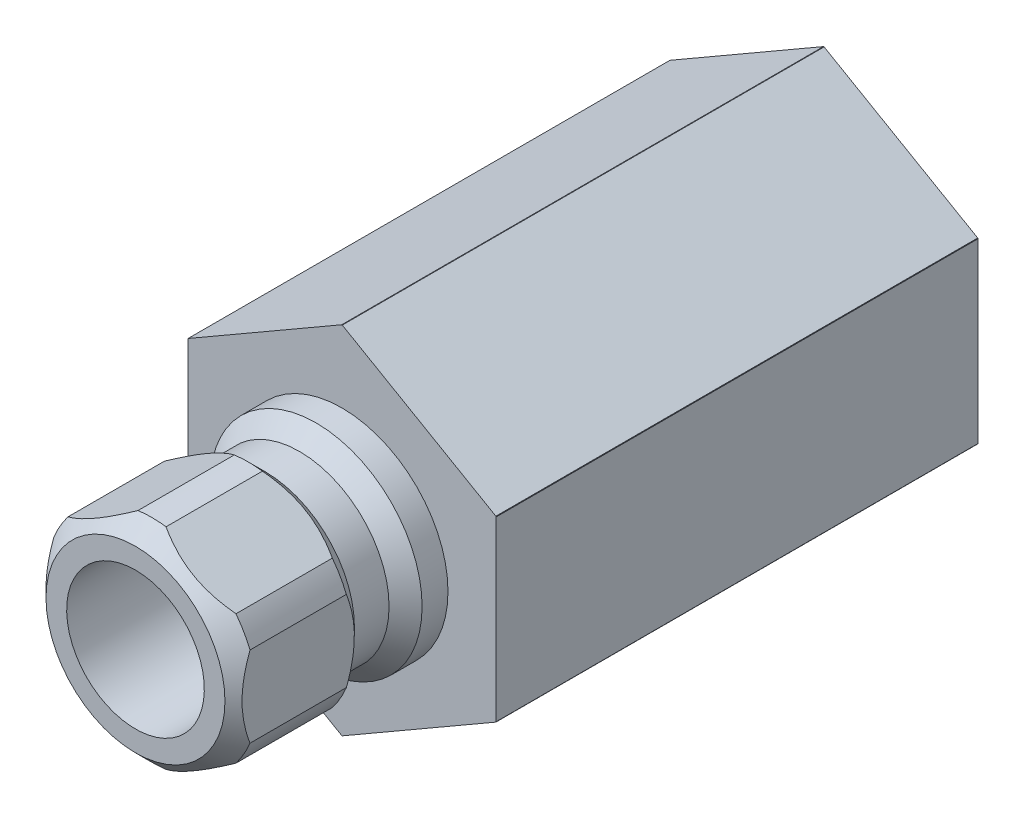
ISO-10303-21;
HEADER;
FILE_DESCRIPTION(('STEP AP214'),'2;1');
FILE_NAME('part.step','',(''),(''),'','','');
FILE_SCHEMA(('AUTOMOTIVE_DESIGN { 1 0 10303 214 1 1 1 1 }'));
ENDSEC;
DATA;
#1=APPLICATION_CONTEXT('core data for automotive mechanical design processes');
#2=APPLICATION_PROTOCOL_DEFINITION('international standard','automotive_design',2000,#1);
#3=PRODUCT_CONTEXT('',#1,'mechanical');
#4=PRODUCT('Part','Part','',(#3));
#5=PRODUCT_RELATED_PRODUCT_CATEGORY('part','',(#4));
#6=PRODUCT_DEFINITION_FORMATION('','',#4);
#7=PRODUCT_DEFINITION_CONTEXT('part definition',#1,'design');
#8=PRODUCT_DEFINITION('design','',#6,#7);
#9=PRODUCT_DEFINITION_SHAPE('','',#8);
#10=(LENGTH_UNIT() NAMED_UNIT(*) SI_UNIT(.MILLI.,.METRE.));
#11=(NAMED_UNIT(*) PLANE_ANGLE_UNIT() SI_UNIT($,.RADIAN.));
#12=(NAMED_UNIT(*) SI_UNIT($,.STERADIAN.) SOLID_ANGLE_UNIT());
#13=UNCERTAINTY_MEASURE_WITH_UNIT(LENGTH_MEASURE(1.E-05),#10,'distance_accuracy_value','');
#14=(GEOMETRIC_REPRESENTATION_CONTEXT(3) GLOBAL_UNCERTAINTY_ASSIGNED_CONTEXT((#13)) GLOBAL_UNIT_ASSIGNED_CONTEXT((#10,
#11,#12)) REPRESENTATION_CONTEXT('',''));
#15=CARTESIAN_POINT('',(0.,0.,0.));
#16=DIRECTION('',(0.,0.,1.));
#17=DIRECTION('',(1.,0.,0.));
#18=AXIS2_PLACEMENT_3D('',#15,#16,#17);
#19=CARTESIAN_POINT('',(0.,0.,0.));
#20=DIRECTION('',(0.,0.,-1.));
#21=DIRECTION('',(0.,1.,0.));
#22=AXIS2_PLACEMENT_3D('',#19,#20,#21);
#23=CYLINDRICAL_SURFACE('',#22,4.8895);
#24=DIRECTION('',(0.,0.,-1.));
#25=VECTOR('',#24,1.);
#26=CARTESIAN_POINT('',(-3.87288738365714,2.98461950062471,0.));
#27=LINE('',#26,#25);
#28=CARTESIAN_POINT('',(-3.87288738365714,2.98461950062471,4.318));
#29=VERTEX_POINT('',#28);
#30=CARTESIAN_POINT('',(-3.87288738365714,2.98461950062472,8.763));
#31=VERTEX_POINT('',#30);
#32=EDGE_CURVE('E54',#29,#31,#27,.F.);
#33=ORIENTED_EDGE('',*,*,#32,.F.);
#34=CARTESIAN_POINT('',(0.,0.,4.318));
#35=DIRECTION('',(0.,0.,-1.));
#36=DIRECTION('',(0.,1.,0.));
#37=AXIS2_PLACEMENT_3D('',#34,#35,#36);
#38=CIRCLE('',#37,4.8895);
#39=CARTESIAN_POINT('',(-4.5212,1.86170910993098,4.318));
#40=VERTEX_POINT('',#39);
#41=EDGE_CURVE('E231',#40,#29,#38,.T.);
#42=ORIENTED_EDGE('',*,*,#41,.F.);
#43=DIRECTION('',(0.,0.,-1.));
#44=VECTOR('',#43,1.);
#45=CARTESIAN_POINT('',(-4.5212,1.86170910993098,0.));
#46=LINE('',#45,#44);
#47=CARTESIAN_POINT('',(-4.5212,1.86170910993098,8.763));
#48=VERTEX_POINT('',#47);
#49=EDGE_CURVE('E411',#48,#40,#46,.T.);
#50=ORIENTED_EDGE('',*,*,#49,.F.);
#51=CARTESIAN_POINT('',(0.,0.,8.763));
#52=DIRECTION('',(0.,0.,-1.));
#53=DIRECTION('',(0.,1.,0.));
#54=AXIS2_PLACEMENT_3D('',#51,#52,#53);
#55=CIRCLE('',#54,4.8895);
#56=EDGE_CURVE('E236',#48,#31,#55,.T.);
#57=ORIENTED_EDGE('',*,*,#56,.T.);
#58=EDGE_LOOP('',(#33,#42,#50,#57));
#59=FACE_BOUND('',#58,.T.);
#60=ADVANCED_FACE('F35',(#59),#23,.T.);
#61=DIRECTION('',(0.,0.,-1.));
#62=VECTOR('',#61,1.);
#63=CARTESIAN_POINT('',(-4.5212,-1.86170910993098,0.));
#64=LINE('',#63,#62);
#65=CARTESIAN_POINT('',(-4.5212,-1.86170910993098,4.318));
#66=VERTEX_POINT('',#65);
#67=CARTESIAN_POINT('',(-4.5212,-1.86170910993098,8.763));
#68=VERTEX_POINT('',#67);
#69=EDGE_CURVE('E62',#66,#68,#64,.F.);
#70=ORIENTED_EDGE('',*,*,#69,.F.);
#71=CARTESIAN_POINT('',(-3.87288738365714,-2.98461950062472,4.318));
#72=VERTEX_POINT('',#71);
#73=EDGE_CURVE('E468',#72,#66,#38,.T.);
#74=ORIENTED_EDGE('',*,*,#73,.F.);
#75=DIRECTION('',(0.,0.,-1.));
#76=VECTOR('',#75,1.);
#77=CARTESIAN_POINT('',(-3.87288738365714,-2.98461950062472,0.));
#78=LINE('',#77,#76);
#79=CARTESIAN_POINT('',(-3.87288738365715,-2.98461950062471,8.763));
#80=VERTEX_POINT('',#79);
#81=EDGE_CURVE('E406',#80,#72,#78,.T.);
#82=ORIENTED_EDGE('',*,*,#81,.F.);
#83=EDGE_CURVE('E241',#80,#68,#55,.T.);
#84=ORIENTED_EDGE('',*,*,#83,.T.);
#85=EDGE_LOOP('',(#70,#74,#82,#84));
#86=FACE_BOUND('',#85,.T.);
#87=ADVANCED_FACE('F403',(#86),#23,.T.);
#88=DIRECTION('',(0.,0.,-1.));
#89=VECTOR('',#88,1.);
#90=CARTESIAN_POINT('',(-0.64831261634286,-4.84632861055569,0.));
#91=LINE('',#90,#89);
#92=CARTESIAN_POINT('',(-0.64831261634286,-4.84632861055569,4.318));
#93=VERTEX_POINT('',#92);
#94=CARTESIAN_POINT('',(-0.648312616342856,-4.84632861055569,8.763));
#95=VERTEX_POINT('',#94);
#96=EDGE_CURVE('E417',#93,#95,#91,.F.);
#97=ORIENTED_EDGE('',*,*,#96,.F.);
#98=CARTESIAN_POINT('',(0.648312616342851,-4.84632861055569,4.318));
#99=VERTEX_POINT('',#98);
#100=EDGE_CURVE('E466',#99,#93,#38,.T.);
#101=ORIENTED_EDGE('',*,*,#100,.F.);
#102=DIRECTION('',(0.,0.,-1.));
#103=VECTOR('',#102,1.);
#104=CARTESIAN_POINT('',(0.648312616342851,-4.84632861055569,0.));
#105=LINE('',#104,#103);
#106=CARTESIAN_POINT('',(0.648312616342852,-4.84632861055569,8.763));
#107=VERTEX_POINT('',#106);
#108=EDGE_CURVE('E452',#107,#99,#105,.T.);
#109=ORIENTED_EDGE('',*,*,#108,.F.);
#110=EDGE_CURVE('E234',#107,#95,#55,.T.);
#111=ORIENTED_EDGE('',*,*,#110,.T.);
#112=EDGE_LOOP('',(#97,#101,#109,#111));
#113=FACE_BOUND('',#112,.T.);
#114=ADVANCED_FACE('F465',(#113),#23,.T.);
#115=DIRECTION('',(0.,0.,-1.));
#116=VECTOR('',#115,1.);
#117=CARTESIAN_POINT('',(3.87288738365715,-2.98461950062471,0.));
#118=LINE('',#117,#116);
#119=CARTESIAN_POINT('',(3.87288738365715,-2.98461950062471,4.318));
#120=VERTEX_POINT('',#119);
#121=CARTESIAN_POINT('',(3.87288738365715,-2.98461950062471,8.763));
#122=VERTEX_POINT('',#121);
#123=EDGE_CURVE('E454',#120,#122,#118,.F.);
#124=ORIENTED_EDGE('',*,*,#123,.F.);
#125=CARTESIAN_POINT('',(4.5212,-1.86170910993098,4.318));
#126=VERTEX_POINT('',#125);
#127=EDGE_CURVE('E393',#126,#120,#38,.T.);
#128=ORIENTED_EDGE('',*,*,#127,.F.);
#129=DIRECTION('',(0.,0.,-1.));
#130=VECTOR('',#129,1.);
#131=CARTESIAN_POINT('',(4.5212,-1.86170910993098,0.));
#132=LINE('',#131,#130);
#133=CARTESIAN_POINT('',(4.5212,-1.86170910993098,8.763));
#134=VERTEX_POINT('',#133);
#135=EDGE_CURVE('E385',#134,#126,#132,.T.);
#136=ORIENTED_EDGE('',*,*,#135,.F.);
#137=EDGE_CURVE('E227',#134,#122,#55,.T.);
#138=ORIENTED_EDGE('',*,*,#137,.T.);
#139=EDGE_LOOP('',(#124,#128,#136,#138));
#140=FACE_BOUND('',#139,.T.);
#141=ADVANCED_FACE('F391',(#140),#23,.T.);
#142=DIRECTION('',(0.,0.,-1.));
#143=VECTOR('',#142,1.);
#144=CARTESIAN_POINT('',(4.5212,1.86170910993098,0.));
#145=LINE('',#144,#143);
#146=CARTESIAN_POINT('',(4.5212,1.86170910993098,4.318));
#147=VERTEX_POINT('',#146);
#148=CARTESIAN_POINT('',(4.5212,1.86170910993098,8.763));
#149=VERTEX_POINT('',#148);
#150=EDGE_CURVE('E387',#147,#149,#145,.F.);
#151=ORIENTED_EDGE('',*,*,#150,.F.);
#152=CARTESIAN_POINT('',(3.87288738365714,2.98461950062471,4.318));
#153=VERTEX_POINT('',#152);
#154=EDGE_CURVE('E220',#153,#147,#38,.T.);
#155=ORIENTED_EDGE('',*,*,#154,.F.);
#156=DIRECTION('',(0.,0.,-1.));
#157=VECTOR('',#156,1.);
#158=CARTESIAN_POINT('',(3.87288738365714,2.98461950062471,0.));
#159=LINE('',#158,#157);
#160=CARTESIAN_POINT('',(3.87288738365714,2.98461950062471,8.763));
#161=VERTEX_POINT('',#160);
#162=EDGE_CURVE('E202',#161,#153,#159,.T.);
#163=ORIENTED_EDGE('',*,*,#162,.F.);
#164=EDGE_CURVE('E218',#161,#149,#55,.T.);
#165=ORIENTED_EDGE('',*,*,#164,.T.);
#166=EDGE_LOOP('',(#151,#155,#163,#165));
#167=FACE_BOUND('',#166,.T.);
#168=ADVANCED_FACE('F217',(#167),#23,.T.);
#169=CARTESIAN_POINT('',(0.,8.2042,-22.225));
#170=DIRECTION('',(0.,0.,-1.));
#171=DIRECTION('',(0.,1.,0.));
#172=AXIS2_PLACEMENT_3D('',#169,#170,#171);
#173=PLANE('',#172);
#174=CARTESIAN_POINT('',(0.,0.,-22.225));
#175=DIRECTION('',(0.,0.,-1.));
#176=DIRECTION('',(0.,1.,0.));
#177=AXIS2_PLACEMENT_3D('',#174,#175,#176);
#178=CIRCLE('',#177,5.91938847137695);
#179=CARTESIAN_POINT('',(0.,5.91938847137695,-22.225));
#180=VERTEX_POINT('',#179);
#181=EDGE_CURVE('E492',#180,#180,#178,.T.);
#182=ORIENTED_EDGE('',*,*,#181,.F.);
#183=EDGE_LOOP('',(#182));
#184=FACE_BOUND('',#183,.T.);
#185=CARTESIAN_POINT('',(0.,0.,-22.225));
#186=DIRECTION('',(0.,0.,-1.));
#187=DIRECTION('',(0.,1.,0.));
#188=AXIS2_PLACEMENT_3D('',#185,#186,#187);
#189=CIRCLE('',#188,8.2042);
#190=CARTESIAN_POINT('',(-7.112,4.09003100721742,-22.225));
#191=VERTEX_POINT('',#190);
#192=CARTESIAN_POINT('',(-7.09807075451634,4.11415716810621,-22.225));
#193=VERTEX_POINT('',#192);
#194=EDGE_CURVE('E490',#191,#193,#189,.T.);
#195=ORIENTED_EDGE('',*,*,#194,.T.);
#196=DIRECTION('',(-0.866025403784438,-0.5,0.));
#197=VECTOR('',#196,1.);
#198=CARTESIAN_POINT('',(0.,8.21223022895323,-22.225));
#199=LINE('',#198,#197);
#200=CARTESIAN_POINT('',(-0.0139292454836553,8.20418817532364,-22.225));
#201=VERTEX_POINT('',#200);
#202=EDGE_CURVE('E294',#201,#193,#199,.T.);
#203=ORIENTED_EDGE('',*,*,#202,.F.);
#204=CARTESIAN_POINT('',(0.0139292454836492,8.20418817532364,-22.225));
#205=VERTEX_POINT('',#204);
#206=EDGE_CURVE('E487',#201,#205,#189,.T.);
#207=ORIENTED_EDGE('',*,*,#206,.T.);
#208=DIRECTION('',(-0.866025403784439,0.5,0.));
#209=VECTOR('',#208,1.);
#210=CARTESIAN_POINT('',(7.112,4.10611511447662,-22.225));
#211=LINE('',#210,#209);
#212=CARTESIAN_POINT('',(7.09807075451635,4.11415716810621,-22.225));
#213=VERTEX_POINT('',#212);
#214=EDGE_CURVE('E284',#213,#205,#211,.T.);
#215=ORIENTED_EDGE('',*,*,#214,.F.);
#216=CARTESIAN_POINT('',(7.112,4.09003100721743,-22.225));
#217=VERTEX_POINT('',#216);
#218=EDGE_CURVE('E491',#213,#217,#189,.T.);
#219=ORIENTED_EDGE('',*,*,#218,.T.);
#220=DIRECTION('',(0.,1.,0.));
#221=VECTOR('',#220,1.);
#222=CARTESIAN_POINT('',(7.112,-4.10611511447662,-22.225));
#223=LINE('',#222,#221);
#224=CARTESIAN_POINT('',(7.112,-4.09003100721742,-22.225));
#225=VERTEX_POINT('',#224);
#226=EDGE_CURVE('E286',#225,#217,#223,.T.);
#227=ORIENTED_EDGE('',*,*,#226,.F.);
#228=CARTESIAN_POINT('',(7.09807075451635,-4.11415716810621,-22.225));
#229=VERTEX_POINT('',#228);
#230=EDGE_CURVE('E547',#225,#229,#189,.T.);
#231=ORIENTED_EDGE('',*,*,#230,.T.);
#232=DIRECTION('',(0.866025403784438,0.5,0.));
#233=VECTOR('',#232,1.);
#234=CARTESIAN_POINT('',(0.,-8.21223022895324,-22.225));
#235=LINE('',#234,#233);
#236=CARTESIAN_POINT('',(0.0139292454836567,-8.20418817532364,-22.225));
#237=VERTEX_POINT('',#236);
#238=EDGE_CURVE('E288',#237,#229,#235,.T.);
#239=ORIENTED_EDGE('',*,*,#238,.F.);
#240=CARTESIAN_POINT('',(-0.0139292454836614,-8.20418817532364,-22.225));
#241=VERTEX_POINT('',#240);
#242=EDGE_CURVE('E550',#237,#241,#189,.T.);
#243=ORIENTED_EDGE('',*,*,#242,.T.);
#244=DIRECTION('',(0.866025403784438,-0.5,0.));
#245=VECTOR('',#244,1.);
#246=CARTESIAN_POINT('',(-7.112,-4.10611511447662,-22.225));
#247=LINE('',#246,#245);
#248=CARTESIAN_POINT('',(-7.09807075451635,-4.11415716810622,-22.225));
#249=VERTEX_POINT('',#248);
#250=EDGE_CURVE('E290',#249,#241,#247,.T.);
#251=ORIENTED_EDGE('',*,*,#250,.F.);
#252=CARTESIAN_POINT('',(-7.112,-4.09003100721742,-22.225));
#253=VERTEX_POINT('',#252);
#254=EDGE_CURVE('E552',#249,#253,#189,.T.);
#255=ORIENTED_EDGE('',*,*,#254,.T.);
#256=DIRECTION('',(0.,-1.,0.));
#257=VECTOR('',#256,1.);
#258=CARTESIAN_POINT('',(-7.112,4.10611511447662,-22.225));
#259=LINE('',#258,#257);
#260=EDGE_CURVE('E292',#191,#253,#259,.T.);
#261=ORIENTED_EDGE('',*,*,#260,.F.);
#262=EDGE_LOOP('',(#195,#203,#207,#215,#219,#227,#231,#239,#243,#251,#255,#261));
#263=FACE_BOUND('',#262,.T.);
#264=ADVANCED_FACE('F559',(#184,#263),#173,.T.);
#265=CARTESIAN_POINT('',(0.,0.,0.));
#266=DIRECTION('',(0.,0.,-1.));
#267=DIRECTION('',(0.,1.,0.));
#268=AXIS2_PLACEMENT_3D('',#265,#266,#267);
#269=CYLINDRICAL_SURFACE('',#268,8.2042);
#270=ORIENTED_EDGE('',*,*,#206,.F.);
#271=DIRECTION('',(0.,0.,-1.));
#272=VECTOR('',#271,1.);
#273=CARTESIAN_POINT('',(-0.0139292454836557,8.20418817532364,0.));
#274=LINE('',#273,#272);
#275=CARTESIAN_POINT('',(-0.0139292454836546,8.20418817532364,0.));
#276=VERTEX_POINT('',#275);
#277=EDGE_CURVE('E246',#201,#276,#274,.F.);
#278=ORIENTED_EDGE('',*,*,#277,.T.);
#279=CARTESIAN_POINT('',(0.,0.,0.));
#280=DIRECTION('',(0.,0.,-1.));
#281=DIRECTION('',(0.,1.,0.));
#282=AXIS2_PLACEMENT_3D('',#279,#280,#281);
#283=CIRCLE('',#282,8.2042);
#284=CARTESIAN_POINT('',(0.0139292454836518,8.20418817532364,0.));
#285=VERTEX_POINT('',#284);
#286=EDGE_CURVE('E482',#276,#285,#283,.T.);
#287=ORIENTED_EDGE('',*,*,#286,.T.);
#288=DIRECTION('',(0.,0.,-1.));
#289=VECTOR('',#288,1.);
#290=CARTESIAN_POINT('',(0.0139292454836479,8.20418817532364,0.));
#291=LINE('',#290,#289);
#292=EDGE_CURVE('E257',#285,#205,#291,.T.);
#293=ORIENTED_EDGE('',*,*,#292,.T.);
#294=EDGE_LOOP('',(#270,#278,#287,#293));
#295=FACE_BOUND('',#294,.T.);
#296=ADVANCED_FACE('F569',(#295),#269,.T.);
#297=CARTESIAN_POINT('',(-7.112,4.09003100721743,0.));
#298=VERTEX_POINT('',#297);
#299=CARTESIAN_POINT('',(-7.09807075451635,4.11415716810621,0.));
#300=VERTEX_POINT('',#299);
#301=EDGE_CURVE('E485',#298,#300,#283,.T.);
#302=ORIENTED_EDGE('',*,*,#301,.T.);
#303=DIRECTION('',(0.,0.,-1.));
#304=VECTOR('',#303,1.);
#305=CARTESIAN_POINT('',(-7.09807075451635,4.11415716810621,0.));
#306=LINE('',#305,#304);
#307=EDGE_CURVE('E251',#300,#193,#306,.T.);
#308=ORIENTED_EDGE('',*,*,#307,.T.);
#309=ORIENTED_EDGE('',*,*,#194,.F.);
#310=DIRECTION('',(0.,0.,-1.));
#311=VECTOR('',#310,1.);
#312=CARTESIAN_POINT('',(-7.112,4.09003100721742,0.));
#313=LINE('',#312,#311);
#314=EDGE_CURVE('E278',#191,#298,#313,.F.);
#315=ORIENTED_EDGE('',*,*,#314,.T.);
#316=EDGE_LOOP('',(#302,#308,#309,#315));
#317=FACE_BOUND('',#316,.T.);
#318=ADVANCED_FACE('F522',(#317),#269,.T.);
#319=ORIENTED_EDGE('',*,*,#218,.F.);
#320=DIRECTION('',(0.,0.,-1.));
#321=VECTOR('',#320,1.);
#322=CARTESIAN_POINT('',(7.09807075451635,4.11415716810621,0.));
#323=LINE('',#322,#321);
#324=CARTESIAN_POINT('',(7.09807075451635,4.11415716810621,0.));
#325=VERTEX_POINT('',#324);
#326=EDGE_CURVE('E254',#213,#325,#323,.F.);
#327=ORIENTED_EDGE('',*,*,#326,.T.);
#328=CARTESIAN_POINT('',(7.112,4.09003100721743,0.));
#329=VERTEX_POINT('',#328);
#330=EDGE_CURVE('E486',#325,#329,#283,.T.);
#331=ORIENTED_EDGE('',*,*,#330,.T.);
#332=DIRECTION('',(0.,0.,-1.));
#333=VECTOR('',#332,1.);
#334=CARTESIAN_POINT('',(7.112,4.09003100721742,0.));
#335=LINE('',#334,#333);
#336=EDGE_CURVE('E263',#329,#217,#335,.T.);
#337=ORIENTED_EDGE('',*,*,#336,.T.);
#338=EDGE_LOOP('',(#319,#327,#331,#337));
#339=FACE_BOUND('',#338,.T.);
#340=ADVANCED_FACE('F541',(#339),#269,.T.);
#341=ORIENTED_EDGE('',*,*,#230,.F.);
#342=DIRECTION('',(0.,0.,-1.));
#343=VECTOR('',#342,1.);
#344=CARTESIAN_POINT('',(7.112,-4.09003100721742,0.));
#345=LINE('',#344,#343);
#346=CARTESIAN_POINT('',(7.112,-4.09003100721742,0.));
#347=VERTEX_POINT('',#346);
#348=EDGE_CURVE('E260',#225,#347,#345,.F.);
#349=ORIENTED_EDGE('',*,*,#348,.T.);
#350=CARTESIAN_POINT('',(7.09807075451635,-4.11415716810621,0.));
#351=VERTEX_POINT('',#350);
#352=EDGE_CURVE('E531',#347,#351,#283,.T.);
#353=ORIENTED_EDGE('',*,*,#352,.T.);
#354=DIRECTION('',(0.,0.,-1.));
#355=VECTOR('',#354,1.);
#356=CARTESIAN_POINT('',(7.09807075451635,-4.11415716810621,0.));
#357=LINE('',#356,#355);
#358=EDGE_CURVE('E269',#351,#229,#357,.T.);
#359=ORIENTED_EDGE('',*,*,#358,.T.);
#360=EDGE_LOOP('',(#341,#349,#353,#359));
#361=FACE_BOUND('',#360,.T.);
#362=ADVANCED_FACE('F545',(#361),#269,.T.);
#363=ORIENTED_EDGE('',*,*,#242,.F.);
#364=DIRECTION('',(0.,0.,-1.));
#365=VECTOR('',#364,1.);
#366=CARTESIAN_POINT('',(0.0139292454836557,-8.20418817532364,0.));
#367=LINE('',#366,#365);
#368=CARTESIAN_POINT('',(0.0139292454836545,-8.20418817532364,0.));
#369=VERTEX_POINT('',#368);
#370=EDGE_CURVE('E266',#237,#369,#367,.F.);
#371=ORIENTED_EDGE('',*,*,#370,.T.);
#372=CARTESIAN_POINT('',(-0.0139292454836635,-8.20418817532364,0.));
#373=VERTEX_POINT('',#372);
#374=EDGE_CURVE('E527',#369,#373,#283,.T.);
#375=ORIENTED_EDGE('',*,*,#374,.T.);
#376=DIRECTION('',(0.,0.,-1.));
#377=VECTOR('',#376,1.);
#378=CARTESIAN_POINT('',(-0.0139292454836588,-8.20418817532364,0.));
#379=LINE('',#378,#377);
#380=EDGE_CURVE('E275',#373,#241,#379,.T.);
#381=ORIENTED_EDGE('',*,*,#380,.T.);
#382=EDGE_LOOP('',(#363,#371,#375,#381));
#383=FACE_BOUND('',#382,.T.);
#384=ADVANCED_FACE('F562',(#383),#269,.T.);
#385=ORIENTED_EDGE('',*,*,#254,.F.);
#386=DIRECTION('',(0.,0.,-1.));
#387=VECTOR('',#386,1.);
#388=CARTESIAN_POINT('',(-7.09807075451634,-4.11415716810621,0.));
#389=LINE('',#388,#387);
#390=CARTESIAN_POINT('',(-7.09807075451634,-4.11415716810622,0.));
#391=VERTEX_POINT('',#390);
#392=EDGE_CURVE('E272',#249,#391,#389,.F.);
#393=ORIENTED_EDGE('',*,*,#392,.T.);
#394=CARTESIAN_POINT('',(-7.112,-4.09003100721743,0.));
#395=VERTEX_POINT('',#394);
#396=EDGE_CURVE('E525',#391,#395,#283,.T.);
#397=ORIENTED_EDGE('',*,*,#396,.T.);
#398=DIRECTION('',(0.,0.,-1.));
#399=VECTOR('',#398,1.);
#400=CARTESIAN_POINT('',(-7.112,-4.09003100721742,0.));
#401=LINE('',#400,#399);
#402=EDGE_CURVE('E281',#395,#253,#401,.T.);
#403=ORIENTED_EDGE('',*,*,#402,.T.);
#404=EDGE_LOOP('',(#385,#393,#397,#403));
#405=FACE_BOUND('',#404,.T.);
#406=ADVANCED_FACE('F561',(#405),#269,.T.);
#407=CARTESIAN_POINT('',(0.,4.8895,0.));
#408=DIRECTION('',(0.,0.,1.));
#409=DIRECTION('',(0.,-1.,0.));
#410=AXIS2_PLACEMENT_3D('',#407,#408,#409);
#411=PLANE('',#410);
#412=CARTESIAN_POINT('',(0.,0.,0.));
#413=DIRECTION('',(0.,0.,-1.));
#414=DIRECTION('',(0.,1.,0.));
#415=AXIS2_PLACEMENT_3D('',#412,#413,#414);
#416=CIRCLE('',#415,4.8895);
#417=CARTESIAN_POINT('',(0.,4.8895,0.));
#418=VERTEX_POINT('',#417);
#419=EDGE_CURVE('E479',#418,#418,#416,.T.);
#420=ORIENTED_EDGE('',*,*,#419,.T.);
#421=EDGE_LOOP('',(#420));
#422=FACE_BOUND('',#421,.T.);
#423=ORIENTED_EDGE('',*,*,#286,.F.);
#424=DIRECTION('',(-0.866025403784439,-0.5,0.));
#425=VECTOR('',#424,1.);
#426=CARTESIAN_POINT('',(-1.43878439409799,7.38154767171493,0.));
#427=LINE('',#426,#425);
#428=EDGE_CURVE('E211',#276,#300,#427,.T.);
#429=ORIENTED_EDGE('',*,*,#428,.T.);
#430=ORIENTED_EDGE('',*,*,#301,.F.);
#431=DIRECTION('',(0.,-1.,0.));
#432=VECTOR('',#431,1.);
#433=CARTESIAN_POINT('',(-7.112,4.8895,0.));
#434=LINE('',#433,#432);
#435=EDGE_CURVE('E501',#298,#395,#434,.T.);
#436=ORIENTED_EDGE('',*,*,#435,.T.);
#437=ORIENTED_EDGE('',*,*,#396,.F.);
#438=DIRECTION('',(0.866025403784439,-0.5,0.));
#439=VECTOR('',#438,1.);
#440=CARTESIAN_POINT('',(-5.67321560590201,-4.93679767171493,0.));
#441=LINE('',#440,#439);
#442=EDGE_CURVE('E504',#391,#373,#441,.T.);
#443=ORIENTED_EDGE('',*,*,#442,.T.);
#444=ORIENTED_EDGE('',*,*,#374,.F.);
#445=DIRECTION('',(0.866025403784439,0.5,0.));
#446=VECTOR('',#445,1.);
#447=CARTESIAN_POINT('',(5.67321560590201,-4.93679767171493,0.));
#448=LINE('',#447,#446);
#449=EDGE_CURVE('E507',#369,#351,#448,.T.);
#450=ORIENTED_EDGE('',*,*,#449,.T.);
#451=ORIENTED_EDGE('',*,*,#352,.F.);
#452=DIRECTION('',(0.,1.,0.));
#453=VECTOR('',#452,1.);
#454=CARTESIAN_POINT('',(7.112,4.8895,0.));
#455=LINE('',#454,#453);
#456=EDGE_CURVE('E510',#347,#329,#455,.T.);
#457=ORIENTED_EDGE('',*,*,#456,.T.);
#458=ORIENTED_EDGE('',*,*,#330,.F.);
#459=DIRECTION('',(-0.866025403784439,0.5,0.));
#460=VECTOR('',#459,1.);
#461=CARTESIAN_POINT('',(1.43878439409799,7.38154767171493,0.));
#462=LINE('',#461,#460);
#463=EDGE_CURVE('E513',#325,#285,#462,.T.);
#464=ORIENTED_EDGE('',*,*,#463,.T.);
#465=EDGE_LOOP('',(#423,#429,#430,#436,#437,#443,#444,#450,#451,#457,#458,#464));
#466=FACE_BOUND('',#465,.T.);
#467=ADVANCED_FACE('F520',(#422,#466),#411,.T.);
#468=CARTESIAN_POINT('',(0.,0.,0.));
#469=DIRECTION('',(0.,0.,-1.));
#470=DIRECTION('',(0.,1.,0.));
#471=AXIS2_PLACEMENT_3D('',#468,#469,#470);
#472=CYLINDRICAL_SURFACE('',#471,3.175);
#473=CARTESIAN_POINT('',(0.,0.,9.525));
#474=DIRECTION('',(0.,0.,-1.));
#475=DIRECTION('',(0.,1.,0.));
#476=AXIS2_PLACEMENT_3D('',#473,#474,#475);
#477=CIRCLE('',#476,3.175);
#478=CARTESIAN_POINT('',(0.,3.175,9.525));
#479=VERTEX_POINT('',#478);
#480=EDGE_CURVE('E243',#479,#479,#477,.T.);
#481=ORIENTED_EDGE('',*,*,#480,.F.);
#482=EDGE_LOOP('',(#481));
#483=FACE_BOUND('',#482,.T.);
#484=CARTESIAN_POINT('',(0.,0.,-10.6045));
#485=DIRECTION('',(0.,0.,-1.));
#486=DIRECTION('',(0.,1.,0.));
#487=AXIS2_PLACEMENT_3D('',#484,#485,#486);
#488=CIRCLE('',#487,3.175);
#489=CARTESIAN_POINT('',(0.,3.175,-10.6045));
#490=VERTEX_POINT('',#489);
#491=EDGE_CURVE('E498',#490,#490,#488,.T.);
#492=ORIENTED_EDGE('',*,*,#491,.T.);
#493=EDGE_LOOP('',(#492));
#494=FACE_BOUND('',#493,.T.);
#495=ADVANCED_FACE('F37',(#483,#494),#472,.F.);
#496=CARTESIAN_POINT('',(0.,3.175,-10.6045));
#497=DIRECTION('',(0.,0.,-1.));
#498=DIRECTION('',(0.,1.,0.));
#499=AXIS2_PLACEMENT_3D('',#496,#497,#498);
#500=PLANE('',#499);
#501=CARTESIAN_POINT('',(0.,0.,-10.6045));
#502=DIRECTION('',(0.,0.,-1.));
#503=DIRECTION('',(0.,1.,0.));
#504=AXIS2_PLACEMENT_3D('',#501,#502,#503);
#505=CIRCLE('',#504,5.55625);
#506=CARTESIAN_POINT('',(0.,5.55625,-10.6045));
#507=VERTEX_POINT('',#506);
#508=EDGE_CURVE('E495',#507,#507,#505,.T.);
#509=ORIENTED_EDGE('',*,*,#508,.T.);
#510=EDGE_LOOP('',(#509));
#511=FACE_BOUND('',#510,.T.);
#512=ORIENTED_EDGE('',*,*,#491,.F.);
#513=EDGE_LOOP('',(#512));
#514=FACE_BOUND('',#513,.T.);
#515=ADVANCED_FACE('F648',(#511,#514),#500,.T.);
#516=CARTESIAN_POINT('',(0.,0.,-10.6045));
#517=DIRECTION('',(0.,0.,-1.));
#518=DIRECTION('',(0.,1.,0.));
#519=AXIS2_PLACEMENT_3D('',#516,#517,#518);
#520=CONICAL_SURFACE('',#519,5.55625,0.0312396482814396);
#521=ORIENTED_EDGE('',*,*,#181,.T.);
#522=EDGE_LOOP('',(#521));
#523=FACE_BOUND('',#522,.T.);
#524=ORIENTED_EDGE('',*,*,#508,.F.);
#525=EDGE_LOOP('',(#524));
#526=FACE_BOUND('',#525,.T.);
#527=ADVANCED_FACE('F737',(#523,#526),#520,.F.);
#528=CARTESIAN_POINT('',(0.,0.,0.));
#529=DIRECTION('',(0.,0.,-1.));
#530=DIRECTION('',(0.,1.,0.));
#531=AXIS2_PLACEMENT_3D('',#528,#529,#530);
#532=CYLINDRICAL_SURFACE('',#531,4.8895);
#533=CARTESIAN_POINT('',(0.,0.,1.1938));
#534=DIRECTION('',(0.,0.,-1.));
#535=DIRECTION('',(0.,1.,0.));
#536=AXIS2_PLACEMENT_3D('',#533,#534,#535);
#537=CIRCLE('',#536,4.8895);
#538=CARTESIAN_POINT('',(0.,4.8895,1.1938));
#539=VERTEX_POINT('',#538);
#540=EDGE_CURVE('E476',#539,#539,#537,.T.);
#541=ORIENTED_EDGE('',*,*,#540,.T.);
#542=EDGE_LOOP('',(#541));
#543=FACE_BOUND('',#542,.T.);
#544=ORIENTED_EDGE('',*,*,#419,.F.);
#545=EDGE_LOOP('',(#544));
#546=FACE_BOUND('',#545,.T.);
#547=ADVANCED_FACE('F727',(#543,#546),#532,.T.);
#548=CARTESIAN_POINT('',(0.,0.,1.1938));
#549=DIRECTION('',(0.,0.,-1.));
#550=DIRECTION('',(0.,1.,0.));
#551=AXIS2_PLACEMENT_3D('',#548,#549,#550);
#552=CONICAL_SURFACE('',#551,4.8895,0.785398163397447);
#553=CARTESIAN_POINT('',(0.,0.,1.9558));
#554=DIRECTION('',(0.,0.,-1.));
#555=DIRECTION('',(0.,1.,0.));
#556=AXIS2_PLACEMENT_3D('',#553,#554,#555);
#557=CIRCLE('',#556,4.1275);
#558=CARTESIAN_POINT('',(0.,4.1275,1.9558));
#559=VERTEX_POINT('',#558);
#560=EDGE_CURVE('E473',#559,#559,#557,.T.);
#561=ORIENTED_EDGE('',*,*,#560,.T.);
#562=EDGE_LOOP('',(#561));
#563=FACE_BOUND('',#562,.T.);
#564=ORIENTED_EDGE('',*,*,#540,.F.);
#565=EDGE_LOOP('',(#564));
#566=FACE_BOUND('',#565,.T.);
#567=ADVANCED_FACE('F717',(#563,#566),#552,.T.);
#568=CARTESIAN_POINT('',(0.,0.,0.));
#569=DIRECTION('',(0.,0.,-1.));
#570=DIRECTION('',(0.,1.,0.));
#571=AXIS2_PLACEMENT_3D('',#568,#569,#570);
#572=CYLINDRICAL_SURFACE('',#571,4.1275);
#573=CARTESIAN_POINT('',(0.,0.,3.556));
#574=DIRECTION('',(0.,0.,-1.));
#575=DIRECTION('',(0.,1.,0.));
#576=AXIS2_PLACEMENT_3D('',#573,#574,#575);
#577=CIRCLE('',#576,4.1275);
#578=CARTESIAN_POINT('',(0.,4.1275,3.556));
#579=VERTEX_POINT('',#578);
#580=EDGE_CURVE('E470',#579,#579,#577,.T.);
#581=ORIENTED_EDGE('',*,*,#580,.T.);
#582=EDGE_LOOP('',(#581));
#583=FACE_BOUND('',#582,.T.);
#584=ORIENTED_EDGE('',*,*,#560,.F.);
#585=EDGE_LOOP('',(#584));
#586=FACE_BOUND('',#585,.T.);
#587=ADVANCED_FACE('F580',(#583,#586),#572,.T.);
#588=CARTESIAN_POINT('',(0.,0.,3.556));
#589=DIRECTION('',(0.,0.,1.));
#590=DIRECTION('',(0.,-1.,0.));
#591=AXIS2_PLACEMENT_3D('',#588,#589,#590);
#592=CONICAL_SURFACE('',#591,4.1275,0.785398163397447);
#593=CARTESIAN_POINT('',(-0.647857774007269,4.84659121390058,4.3182));
#594=CARTESIAN_POINT('',(-0.775261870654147,4.77303442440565,4.26213711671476));
#595=CARTESIAN_POINT('',(-0.904457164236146,4.69844348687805,4.21102627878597));
#596=CARTESIAN_POINT('',(-1.16629518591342,4.5472712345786,4.12074318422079));
#597=CARTESIAN_POINT('',(-1.29894624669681,4.47068510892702,4.08160338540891));
#598=CARTESIAN_POINT('',(-1.56203676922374,4.31878972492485,4.01877592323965));
#599=CARTESIAN_POINT('',(-1.69238331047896,4.24353411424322,3.99458163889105));
#600=CARTESIAN_POINT('',(-1.95434729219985,4.09228913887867,3.96102228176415));
#601=CARTESIAN_POINT('',(-2.0859628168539,4.01630088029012,3.95163757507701));
#602=CARTESIAN_POINT('',(-2.35623055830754,3.86026172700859,3.9482192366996));
#603=CARTESIAN_POINT('',(-2.49489129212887,3.78020591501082,3.95501290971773));
#604=CARTESIAN_POINT('',(-2.7710334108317,3.62077518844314,3.98518499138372));
#605=CARTESIAN_POINT('',(-2.90851272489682,3.54140146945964,4.00858815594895));
#606=CARTESIAN_POINT('',(-3.18622016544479,3.38106700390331,4.07155129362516));
#607=CARTESIAN_POINT('',(-3.32634361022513,3.3001666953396,4.11171074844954));
#608=CARTESIAN_POINT('',(-3.60275664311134,3.14057955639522,4.20550294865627));
#609=CARTESIAN_POINT('',(-3.73905611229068,3.06188702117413,4.2590965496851));
#610=CARTESIAN_POINT('',(-3.87334222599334,2.98435689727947,4.31820000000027));
#611=B_SPLINE_CURVE_WITH_KNOTS('',3,(#593,#594,#595,#596,#597,#598,#599,#600,#601,#602,#603,
#604,#605,#606,#607,#608,#609,#610),.UNSPECIFIED.,.F.,.F.,(4,2,2,2,2,2,2,2,4),(0.,
0.472469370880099,0.946208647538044,1.40285320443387,1.85889185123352,2.33874707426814,
2.81931901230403,3.31879975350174,3.81684169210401),.UNSPECIFIED.);
#612=CARTESIAN_POINT('',(-0.648312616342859,4.84632861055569,4.318));
#613=VERTEX_POINT('',#612);
#614=EDGE_CURVE('E296',#613,#29,#611,.T.);
#615=ORIENTED_EDGE('',*,*,#614,.F.);
#616=CARTESIAN_POINT('',(0.648312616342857,4.84632861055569,4.318));
#617=VERTEX_POINT('',#616);
#618=EDGE_CURVE('E226',#613,#617,#38,.T.);
#619=ORIENTED_EDGE('',*,*,#618,.T.);
#620=CARTESIAN_POINT('',(3.87334222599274,2.98435689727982,4.3182));
#621=CARTESIAN_POINT('',(3.74593812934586,3.05791368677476,4.26213711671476));
#622=CARTESIAN_POINT('',(3.61674283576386,3.13250462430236,4.21102627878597));
#623=CARTESIAN_POINT('',(3.35490481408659,3.28367687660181,4.12074318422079));
#624=CARTESIAN_POINT('',(3.2222537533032,3.36026300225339,4.08160338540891));
#625=CARTESIAN_POINT('',(2.95916323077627,3.51215838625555,4.01877592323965));
#626=CARTESIAN_POINT('',(2.82881668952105,3.58741399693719,3.99458163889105));
#627=CARTESIAN_POINT('',(2.56685270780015,3.73865897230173,3.96102228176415));
#628=CARTESIAN_POINT('',(2.4352371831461,3.81464723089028,3.95163757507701));
#629=CARTESIAN_POINT('',(2.16496944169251,3.97068638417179,3.9482192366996));
#630=CARTESIAN_POINT('',(2.02630870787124,4.05074219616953,3.95501290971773));
#631=CARTESIAN_POINT('',(1.75016658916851,4.21017292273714,3.98518499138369));
#632=CARTESIAN_POINT('',(1.61268727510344,4.28954664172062,4.00858815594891));
#633=CARTESIAN_POINT('',(1.33497983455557,4.44988110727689,4.07155129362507));
#634=CARTESIAN_POINT('',(1.19485638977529,4.53078141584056,4.11171074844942));
#635=CARTESIAN_POINT('',(0.918443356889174,4.69036855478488,4.20550294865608));
#636=CARTESIAN_POINT('',(0.782143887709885,4.76906109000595,4.25909654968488));
#637=CARTESIAN_POINT('',(0.647857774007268,4.84659121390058,4.3182));
#638=B_SPLINE_CURVE_WITH_KNOTS('',3,(#620,#621,#622,#623,#624,#625,#626,#627,#628,#629,#630,
#631,#632,#633,#634,#635,#636,#637),.UNSPECIFIED.,.F.,.F.,(4,2,2,2,2,2,2,2,4),(0.,
0.472469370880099,0.946208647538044,1.40285320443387,1.85889185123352,2.33874707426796,
2.81931901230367,3.31879975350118,3.81684169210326),.UNSPECIFIED.);
#639=EDGE_CURVE('E394',#153,#617,#638,.T.);
#640=ORIENTED_EDGE('',*,*,#639,.F.);
#641=ORIENTED_EDGE('',*,*,#154,.T.);
#642=CARTESIAN_POINT('',(4.5212,-5.15925306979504,6.2884665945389));
#643=CARTESIAN_POINT('',(4.5212,-5.03341781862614,6.19384981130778));
#644=CARTESIAN_POINT('',(4.5212,-4.90687282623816,6.10016148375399));
#645=CARTESIAN_POINT('',(4.5212,-4.65208542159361,5.91505573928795));
#646=CARTESIAN_POINT('',(4.5212,-4.52384258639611,5.82363890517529));
#647=CARTESIAN_POINT('',(4.5212,-4.26444371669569,5.64284060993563));
#648=CARTESIAN_POINT('',(4.5212,-4.13327280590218,5.55348041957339));
#649=CARTESIAN_POINT('',(4.5212,-3.86869655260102,5.37814219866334));
#650=CARTESIAN_POINT('',(4.5212,-3.735291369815,5.29216392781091));
#651=CARTESIAN_POINT('',(4.5212,-3.45835736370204,5.1196421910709));
#652=CARTESIAN_POINT('',(4.5212,-3.31467977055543,5.03333631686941));
#653=CARTESIAN_POINT('',(4.5212,-3.02397608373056,4.86646929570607));
#654=CARTESIAN_POINT('',(4.5212,-2.87694947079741,4.78590904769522));
#655=CARTESIAN_POINT('',(4.5212,-2.57957206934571,4.6322757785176));
#656=CARTESIAN_POINT('',(4.5212,-2.42923274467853,4.55918074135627));
#657=CARTESIAN_POINT('',(4.5212,-2.12448469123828,4.4221138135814));
#658=CARTESIAN_POINT('',(4.5212,-1.97007782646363,4.35813782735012));
#659=CARTESIAN_POINT('',(4.5212,-1.66898205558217,4.24604782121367));
#660=CARTESIAN_POINT('',(4.5212,-1.52260919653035,4.19709368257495));
#661=CARTESIAN_POINT('',(4.5212,-1.22638031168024,4.11093488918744));
#662=CARTESIAN_POINT('',(4.5212,-1.07652404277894,4.07373105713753));
#663=CARTESIAN_POINT('',(4.5212,-0.776693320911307,4.01362130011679));
#664=CARTESIAN_POINT('',(4.5212,-0.626768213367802,3.99047322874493));
#665=CARTESIAN_POINT('',(4.5212,-0.325366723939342,3.95891692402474));
#666=CARTESIAN_POINT('',(4.5212,-0.173890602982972,3.95050625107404));
#667=CARTESIAN_POINT('',(4.5212,0.123852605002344,3.94903068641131));
#668=CARTESIAN_POINT('',(4.5212,0.270117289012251,3.95544130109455));
#669=CARTESIAN_POINT('',(4.5212,0.561370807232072,3.98210770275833));
#670=CARTESIAN_POINT('',(4.5212,0.706359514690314,4.0023648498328));
#671=CARTESIAN_POINT('',(4.5212,0.996462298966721,4.05597163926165));
#672=CARTESIAN_POINT('',(4.5212,1.14153485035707,4.08954247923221));
#673=CARTESIAN_POINT('',(4.5212,1.42852462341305,4.16800024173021));
#674=CARTESIAN_POINT('',(4.5212,1.5704421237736,4.21288616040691));
#675=CARTESIAN_POINT('',(4.5212,1.86505501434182,4.3171412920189));
#676=CARTESIAN_POINT('',(4.5212,2.01739126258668,4.37751543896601));
#677=CARTESIAN_POINT('',(4.5212,2.318097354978,4.5075182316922));
#678=CARTESIAN_POINT('',(4.5212,2.46646529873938,4.57715121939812));
#679=CARTESIAN_POINT('',(4.5212,2.75996557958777,4.72401353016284));
#680=CARTESIAN_POINT('',(4.5212,2.90508583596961,4.80126680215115));
#681=CARTESIAN_POINT('',(4.5212,3.1919833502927,4.96166050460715));
#682=CARTESIAN_POINT('',(4.5212,3.33376113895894,5.04479999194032));
#683=CARTESIAN_POINT('',(4.5212,3.60742153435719,5.21154136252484));
#684=CARTESIAN_POINT('',(4.5212,3.73944496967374,5.29491333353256));
#685=CARTESIAN_POINT('',(4.5212,4.00122581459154,5.4651527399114));
#686=CARTESIAN_POINT('',(4.5212,4.13098305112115,5.55202044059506));
#687=CARTESIAN_POINT('',(4.5212,4.38747396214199,5.72790624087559));
#688=CARTESIAN_POINT('',(4.5212,4.51422365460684,5.81690106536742));
#689=CARTESIAN_POINT('',(4.5212,4.76599253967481,5.99723636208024));
#690=CARTESIAN_POINT('',(4.5212,4.8910121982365,6.08857618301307));
#691=CARTESIAN_POINT('',(4.5212,5.01530771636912,6.18087446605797));
#692=B_SPLINE_CURVE_WITH_KNOTS('',3,(#642,#643,#644,#645,#646,#647,#648,#649,#650,#651,#652,
#653,#654,#655,#656,#657,#658,#659,#660,#661,#662,#663,#664,#665,#666,#667,#668,#669,#670,#671,
#672,#673,#674,#675,#676,#677,#678,#679,#680,#681,#682,#683,#684,#685,#686,#687,#688,#689,#690,
#691),.UNSPECIFIED.,.F.,.F.,(4,2,2,2,2,2,2,2,2,2,2,2,2,2,2,2,2,2,2,2,2,2,2,2,4),(0.,
0.472324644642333,0.944769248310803,1.42087610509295,1.89694907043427,2.39966187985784,
2.90245317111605,3.40371602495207,3.90475303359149,4.36737130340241,4.8300219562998,
5.28445770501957,5.73881822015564,6.1773471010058,6.615919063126,7.06210522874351,
7.50825182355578,7.99945943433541,8.49089821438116,8.98393391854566,9.47689080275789,
9.9452592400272,10.4136632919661,10.8782525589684,11.3427141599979),.UNSPECIFIED.);
#693=EDGE_CURVE('E447',#126,#147,#692,.T.);
#694=ORIENTED_EDGE('',*,*,#693,.F.);
#695=ORIENTED_EDGE('',*,*,#127,.T.);
#696=CARTESIAN_POINT('',(0.647857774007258,-4.84659121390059,4.3182));
#697=CARTESIAN_POINT('',(0.775261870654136,-4.77303442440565,4.26213711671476));
#698=CARTESIAN_POINT('',(0.904457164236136,-4.69844348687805,4.21102627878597));
#699=CARTESIAN_POINT('',(1.16629518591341,-4.5472712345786,4.12074318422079));
#700=CARTESIAN_POINT('',(1.2989462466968,-4.47068510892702,4.08160338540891));
#701=CARTESIAN_POINT('',(1.56203676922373,-4.31878972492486,4.01877592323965));
#702=CARTESIAN_POINT('',(1.69238331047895,-4.24353411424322,3.99458163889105));
#703=CARTESIAN_POINT('',(1.95434729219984,-4.09228913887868,3.96102228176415));
#704=CARTESIAN_POINT('',(2.08596281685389,-4.01630088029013,3.951637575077));
#705=CARTESIAN_POINT('',(2.35623055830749,-3.86026172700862,3.9482192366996));
#706=CARTESIAN_POINT('',(2.49489129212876,-3.78020591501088,3.95501290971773));
#707=CARTESIAN_POINT('',(2.77103341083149,-3.62077518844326,3.98518499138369));
#708=CARTESIAN_POINT('',(2.90851272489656,-3.54140146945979,4.00858815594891));
#709=CARTESIAN_POINT('',(3.18622016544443,-3.38106700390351,4.07155129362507));
#710=CARTESIAN_POINT('',(3.32634361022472,-3.30016669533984,4.11171074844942));
#711=CARTESIAN_POINT('',(3.60275664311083,-3.14057955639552,4.20550294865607));
#712=CARTESIAN_POINT('',(3.73905611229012,-3.06188702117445,4.25909654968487));
#713=CARTESIAN_POINT('',(3.87334222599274,-2.98435689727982,4.3182));
#714=B_SPLINE_CURVE_WITH_KNOTS('',3,(#696,#697,#698,#699,#700,#701,#702,#703,#704,#705,#706,
#707,#708,#709,#710,#711,#712,#713),.UNSPECIFIED.,.F.,.F.,(4,2,2,2,2,2,2,2,4),(0.,
0.472469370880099,0.946208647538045,1.40285320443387,1.85889185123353,2.33874707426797,
2.81931901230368,3.31879975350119,3.81684169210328),.UNSPECIFIED.);
#715=EDGE_CURVE('E456',#99,#120,#714,.T.);
#716=ORIENTED_EDGE('',*,*,#715,.F.);
#717=ORIENTED_EDGE('',*,*,#100,.T.);
#718=CARTESIAN_POINT('',(-3.87334222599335,-2.98435689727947,4.31820000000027));
#719=CARTESIAN_POINT('',(-3.74593812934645,-3.05791368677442,4.262137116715));
#720=CARTESIAN_POINT('',(-3.61674283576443,-3.13250462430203,4.21102627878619));
#721=CARTESIAN_POINT('',(-3.35490481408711,-3.28367687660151,4.12074318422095));
#722=CARTESIAN_POINT('',(-3.2222537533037,-3.3602630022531,4.08160338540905));
#723=CARTESIAN_POINT('',(-2.95916323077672,-3.51215838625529,4.01877592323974));
#724=CARTESIAN_POINT('',(-2.82881668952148,-3.58741399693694,3.99458163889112));
#725=CARTESIAN_POINT('',(-2.56685270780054,-3.73865897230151,3.96102228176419));
#726=CARTESIAN_POINT('',(-2.43523718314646,-3.81464723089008,3.95163757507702));
#727=CARTESIAN_POINT('',(-2.16496944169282,-3.97068638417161,3.94821923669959));
#728=CARTESIAN_POINT('',(-2.02630870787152,-4.05074219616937,3.95501290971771));
#729=CARTESIAN_POINT('',(-1.75016658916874,-4.21017292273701,3.98518499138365));
#730=CARTESIAN_POINT('',(-1.61268727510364,-4.2895466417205,4.00858815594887));
#731=CARTESIAN_POINT('',(-1.33497983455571,-4.44988110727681,4.07155129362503));
#732=CARTESIAN_POINT('',(-1.1948563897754,-4.5307814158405,4.11171074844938));
#733=CARTESIAN_POINT('',(-0.918443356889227,-4.69036855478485,4.20550294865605));
#734=CARTESIAN_POINT('',(-0.78214388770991,-4.76906109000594,4.25909654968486));
#735=CARTESIAN_POINT('',(-0.647857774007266,-4.84659121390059,4.3182));
#736=B_SPLINE_CURVE_WITH_KNOTS('',3,(#718,#719,#720,#721,#722,#723,#724,#725,#726,#727,#728,
#729,#730,#731,#732,#733,#734,#735),.UNSPECIFIED.,.F.,.F.,(4,2,2,2,2,2,2,2,4),(0.,
0.472469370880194,0.946208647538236,1.40285320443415,1.85889185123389,2.33874707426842,
2.81931901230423,3.31879975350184,3.81684169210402),.UNSPECIFIED.);
#737=EDGE_CURVE('E413',#72,#93,#736,.T.);
#738=ORIENTED_EDGE('',*,*,#737,.F.);
#739=ORIENTED_EDGE('',*,*,#73,.T.);
#740=CARTESIAN_POINT('',(-4.5212,-5.15925306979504,6.2884665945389));
#741=CARTESIAN_POINT('',(-4.5212,-5.03341781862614,6.19384981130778));
#742=CARTESIAN_POINT('',(-4.5212,-4.90687282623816,6.10016148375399));
#743=CARTESIAN_POINT('',(-4.5212,-4.65208542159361,5.91505573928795));
#744=CARTESIAN_POINT('',(-4.5212,-4.52384258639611,5.82363890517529));
#745=CARTESIAN_POINT('',(-4.5212,-4.26444371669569,5.64284060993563));
#746=CARTESIAN_POINT('',(-4.5212,-4.13327280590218,5.55348041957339));
#747=CARTESIAN_POINT('',(-4.5212,-3.86869655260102,5.37814219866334));
#748=CARTESIAN_POINT('',(-4.5212,-3.735291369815,5.29216392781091));
#749=CARTESIAN_POINT('',(-4.5212,-3.45835736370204,5.1196421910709));
#750=CARTESIAN_POINT('',(-4.5212,-3.31467977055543,5.03333631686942));
#751=CARTESIAN_POINT('',(-4.5212,-3.02397608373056,4.86646929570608));
#752=CARTESIAN_POINT('',(-4.5212,-2.87694947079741,4.78590904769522));
#753=CARTESIAN_POINT('',(-4.5212,-2.57957206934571,4.6322757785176));
#754=CARTESIAN_POINT('',(-4.5212,-2.42923274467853,4.55918074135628));
#755=CARTESIAN_POINT('',(-4.5212,-2.12448469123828,4.4221138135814));
#756=CARTESIAN_POINT('',(-4.5212,-1.97007782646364,4.35813782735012));
#757=CARTESIAN_POINT('',(-4.5212,-1.66898205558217,4.24604782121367));
#758=CARTESIAN_POINT('',(-4.5212,-1.52260919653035,4.19709368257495));
#759=CARTESIAN_POINT('',(-4.5212,-1.22638031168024,4.11093488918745));
#760=CARTESIAN_POINT('',(-4.5212,-1.07652404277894,4.07373105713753));
#761=CARTESIAN_POINT('',(-4.5212,-0.776693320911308,4.01362130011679));
#762=CARTESIAN_POINT('',(-4.5212,-0.626768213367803,3.99047322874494));
#763=CARTESIAN_POINT('',(-4.5212,-0.325366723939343,3.95891692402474));
#764=CARTESIAN_POINT('',(-4.5212,-0.173890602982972,3.95050625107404));
#765=CARTESIAN_POINT('',(-4.5212,0.123852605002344,3.94903068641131));
#766=CARTESIAN_POINT('',(-4.5212,0.270117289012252,3.95544130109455));
#767=CARTESIAN_POINT('',(-4.5212,0.561370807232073,3.98210770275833));
#768=CARTESIAN_POINT('',(-4.5212,0.706359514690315,4.0023648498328));
#769=CARTESIAN_POINT('',(-4.5212,0.996462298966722,4.05597163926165));
#770=CARTESIAN_POINT('',(-4.5212,1.14153485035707,4.08954247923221));
#771=CARTESIAN_POINT('',(-4.5212,1.42852462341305,4.16800024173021));
#772=CARTESIAN_POINT('',(-4.5212,1.5704421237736,4.21288616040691));
#773=CARTESIAN_POINT('',(-4.5212,1.86505501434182,4.3171412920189));
#774=CARTESIAN_POINT('',(-4.5212,2.01739126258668,4.37751543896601));
#775=CARTESIAN_POINT('',(-4.5212,2.31809735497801,4.5075182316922));
#776=CARTESIAN_POINT('',(-4.5212,2.46646529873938,4.57715121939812));
#777=CARTESIAN_POINT('',(-4.5212,2.75996557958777,4.72401353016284));
#778=CARTESIAN_POINT('',(-4.5212,2.90508583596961,4.80126680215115));
#779=CARTESIAN_POINT('',(-4.5212,3.1919833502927,4.96166050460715));
#780=CARTESIAN_POINT('',(-4.5212,3.33376113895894,5.04479999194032));
#781=CARTESIAN_POINT('',(-4.5212,3.60742153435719,5.21154136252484));
#782=CARTESIAN_POINT('',(-4.5212,3.73944496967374,5.29491333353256));
#783=CARTESIAN_POINT('',(-4.5212,4.00122581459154,5.4651527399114));
#784=CARTESIAN_POINT('',(-4.5212,4.13098305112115,5.55202044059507));
#785=CARTESIAN_POINT('',(-4.5212,4.38747396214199,5.72790624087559));
#786=CARTESIAN_POINT('',(-4.5212,4.51422365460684,5.81690106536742));
#787=CARTESIAN_POINT('',(-4.5212,4.76599253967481,5.99723636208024));
#788=CARTESIAN_POINT('',(-4.5212,4.8910121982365,6.08857618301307));
#789=CARTESIAN_POINT('',(-4.5212,5.01530771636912,6.18087446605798));
#790=B_SPLINE_CURVE_WITH_KNOTS('',3,(#740,#741,#742,#743,#744,#745,#746,#747,#748,#749,#750,
#751,#752,#753,#754,#755,#756,#757,#758,#759,#760,#761,#762,#763,#764,#765,#766,#767,#768,#769,
#770,#771,#772,#773,#774,#775,#776,#777,#778,#779,#780,#781,#782,#783,#784,#785,#786,#787,#788,
#789),.UNSPECIFIED.,.F.,.F.,(4,2,2,2,2,2,2,2,2,2,2,2,2,2,2,2,2,2,2,2,2,2,2,2,4),(0.,
0.472324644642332,0.944769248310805,1.42087610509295,1.89694907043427,2.39966187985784,
2.90245317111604,3.40371602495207,3.90475303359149,4.36737130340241,4.8300219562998,
5.28445770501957,5.73881822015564,6.1773471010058,6.615919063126,7.06210522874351,
7.50825182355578,7.99945943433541,8.49089821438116,8.98393391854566,9.47689080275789,
9.9452592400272,10.4136632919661,10.8782525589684,11.3427141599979),.UNSPECIFIED.);
#791=EDGE_CURVE('E415',#40,#66,#790,.F.);
#792=ORIENTED_EDGE('',*,*,#791,.F.);
#793=ORIENTED_EDGE('',*,*,#41,.T.);
#794=EDGE_LOOP('',(#615,#619,#640,#641,#694,#695,#716,#717,#738,#739,#792,#793));
#795=FACE_BOUND('',#794,.T.);
#796=ORIENTED_EDGE('',*,*,#580,.F.);
#797=EDGE_LOOP('',(#796));
#798=FACE_BOUND('',#797,.T.);
#799=ADVANCED_FACE('F303',(#795,#798),#592,.T.);
#800=DIRECTION('',(0.,0.,-1.));
#801=VECTOR('',#800,1.);
#802=CARTESIAN_POINT('',(-0.648312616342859,4.84632861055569,0.));
#803=LINE('',#802,#801);
#804=CARTESIAN_POINT('',(-0.64831261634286,4.84632861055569,8.763));
#805=VERTEX_POINT('',#804);
#806=EDGE_CURVE('E427',#805,#613,#803,.T.);
#807=ORIENTED_EDGE('',*,*,#806,.F.);
#808=CARTESIAN_POINT('',(0.64831261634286,4.84632861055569,8.763));
#809=VERTEX_POINT('',#808);
#810=EDGE_CURVE('E229',#805,#809,#55,.T.);
#811=ORIENTED_EDGE('',*,*,#810,.T.);
#812=DIRECTION('',(0.,0.,-1.));
#813=VECTOR('',#812,1.);
#814=CARTESIAN_POINT('',(0.648312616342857,4.84632861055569,0.));
#815=LINE('',#814,#813);
#816=EDGE_CURVE('E205',#617,#809,#815,.F.);
#817=ORIENTED_EDGE('',*,*,#816,.F.);
#818=ORIENTED_EDGE('',*,*,#618,.F.);
#819=EDGE_LOOP('',(#807,#811,#817,#818));
#820=FACE_BOUND('',#819,.T.);
#821=ADVANCED_FACE('F345',(#820),#23,.T.);
#822=CARTESIAN_POINT('',(0.,0.,8.763));
#823=DIRECTION('',(0.,0.,-1.));
#824=DIRECTION('',(0.,1.,0.));
#825=AXIS2_PLACEMENT_3D('',#822,#823,#824);
#826=CONICAL_SURFACE('',#825,4.8895,0.785398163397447);
#827=CARTESIAN_POINT('',(-3.87334222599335,2.98435689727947,8.76279999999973));
#828=CARTESIAN_POINT('',(-3.74593812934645,3.05791368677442,8.81886288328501));
#829=CARTESIAN_POINT('',(-3.61674283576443,3.13250462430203,8.86997372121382));
#830=CARTESIAN_POINT('',(-3.35490481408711,3.28367687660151,8.96025681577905));
#831=CARTESIAN_POINT('',(-3.2222537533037,3.3602630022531,8.99939661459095));
#832=CARTESIAN_POINT('',(-2.95916323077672,3.51215838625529,9.06222407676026));
#833=CARTESIAN_POINT('',(-2.82881668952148,3.58741399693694,9.08641836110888));
#834=CARTESIAN_POINT('',(-2.56685270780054,3.73865897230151,9.11997771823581));
#835=CARTESIAN_POINT('',(-2.43523718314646,3.81464723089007,9.12936242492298));
#836=CARTESIAN_POINT('',(-2.16496944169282,3.97068638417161,9.13278076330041));
#837=CARTESIAN_POINT('',(-2.02630870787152,4.05074219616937,9.12598709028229));
#838=CARTESIAN_POINT('',(-1.75016658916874,4.21017292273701,9.09581500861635));
#839=CARTESIAN_POINT('',(-1.61268727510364,4.2895466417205,9.07241184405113));
#840=CARTESIAN_POINT('',(-1.33497983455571,4.44988110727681,9.00944870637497));
#841=CARTESIAN_POINT('',(-1.1948563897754,4.5307814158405,8.96928925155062));
#842=CARTESIAN_POINT('',(-0.918443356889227,4.69036855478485,8.87549705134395));
#843=CARTESIAN_POINT('',(-0.78214388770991,4.76906109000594,8.82190345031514));
#844=CARTESIAN_POINT('',(-0.647857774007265,4.84659121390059,8.7628));
#845=B_SPLINE_CURVE_WITH_KNOTS('',3,(#827,#828,#829,#830,#831,#832,#833,#834,#835,#836,#837,
#838,#839,#840,#841,#842,#843,#844),.UNSPECIFIED.,.F.,.F.,(4,2,2,2,2,2,2,2,4),(0.,
0.472469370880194,0.946208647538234,1.40285320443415,1.85889185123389,2.33874707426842,
2.81931901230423,3.31879975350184,3.81684169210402),.UNSPECIFIED.);
#846=EDGE_CURVE('E12',#31,#805,#845,.T.);
#847=ORIENTED_EDGE('',*,*,#846,.F.);
#848=ORIENTED_EDGE('',*,*,#56,.F.);
#849=CARTESIAN_POINT('',(-4.5212,-5.15925306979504,6.7925334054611));
#850=CARTESIAN_POINT('',(-4.5212,-5.03341781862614,6.88715018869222));
#851=CARTESIAN_POINT('',(-4.5212,-4.90687282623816,6.98083851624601));
#852=CARTESIAN_POINT('',(-4.5212,-4.65208542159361,7.16594426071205));
#853=CARTESIAN_POINT('',(-4.5212,-4.52384258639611,7.25736109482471));
#854=CARTESIAN_POINT('',(-4.5212,-4.26444371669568,7.43815939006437));
#855=CARTESIAN_POINT('',(-4.5212,-4.13327280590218,7.52751958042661));
#856=CARTESIAN_POINT('',(-4.5212,-3.86869655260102,7.70285780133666));
#857=CARTESIAN_POINT('',(-4.5212,-3.735291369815,7.78883607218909));
#858=CARTESIAN_POINT('',(-4.5212,-3.45835736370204,7.9613578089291));
#859=CARTESIAN_POINT('',(-4.5212,-3.31467977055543,8.04766368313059));
#860=CARTESIAN_POINT('',(-4.5212,-3.02397608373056,8.21453070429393));
#861=CARTESIAN_POINT('',(-4.5212,-2.87694947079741,8.29509095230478));
#862=CARTESIAN_POINT('',(-4.5212,-2.57957206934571,8.4487242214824));
#863=CARTESIAN_POINT('',(-4.5212,-2.42923274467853,8.52181925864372));
#864=CARTESIAN_POINT('',(-4.5212,-2.12448469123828,8.6588861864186));
#865=CARTESIAN_POINT('',(-4.5212,-1.97007782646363,8.72286217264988));
#866=CARTESIAN_POINT('',(-4.5212,-1.66898205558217,8.83495217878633));
#867=CARTESIAN_POINT('',(-4.5212,-1.52260919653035,8.88390631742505));
#868=CARTESIAN_POINT('',(-4.5212,-1.22638031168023,8.97006511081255));
#869=CARTESIAN_POINT('',(-4.5212,-1.07652404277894,9.00726894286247));
#870=CARTESIAN_POINT('',(-4.5212,-0.776693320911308,9.06737869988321));
#871=CARTESIAN_POINT('',(-4.5212,-0.626768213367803,9.09052677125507));
#872=CARTESIAN_POINT('',(-4.5212,-0.325366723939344,9.12208307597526));
#873=CARTESIAN_POINT('',(-4.5212,-0.173890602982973,9.13049374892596));
#874=CARTESIAN_POINT('',(-4.5212,0.123852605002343,9.13196931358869));
#875=CARTESIAN_POINT('',(-4.5212,0.27011728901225,9.12555869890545));
#876=CARTESIAN_POINT('',(-4.5212,0.561370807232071,9.09889229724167));
#877=CARTESIAN_POINT('',(-4.5212,0.706359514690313,9.0786351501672));
#878=CARTESIAN_POINT('',(-4.5212,0.996462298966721,9.02502836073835));
#879=CARTESIAN_POINT('',(-4.5212,1.14153485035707,8.99145752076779));
#880=CARTESIAN_POINT('',(-4.5212,1.42852462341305,8.91299975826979));
#881=CARTESIAN_POINT('',(-4.5212,1.5704421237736,8.86811383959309));
#882=CARTESIAN_POINT('',(-4.5212,1.86505501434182,8.7638587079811));
#883=CARTESIAN_POINT('',(-4.5212,2.01739126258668,8.703484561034));
#884=CARTESIAN_POINT('',(-4.5212,2.318097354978,8.5734817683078));
#885=CARTESIAN_POINT('',(-4.5212,2.46646529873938,8.50384878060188));
#886=CARTESIAN_POINT('',(-4.5212,2.75996557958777,8.35698646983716));
#887=CARTESIAN_POINT('',(-4.5212,2.9050858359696,8.27973319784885));
#888=CARTESIAN_POINT('',(-4.5212,3.1919833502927,8.11933949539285));
#889=CARTESIAN_POINT('',(-4.5212,3.33376113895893,8.03620000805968));
#890=CARTESIAN_POINT('',(-4.5212,3.60742153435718,7.86945863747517));
#891=CARTESIAN_POINT('',(-4.5212,3.73944496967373,7.78608666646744));
#892=CARTESIAN_POINT('',(-4.5212,4.00122581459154,7.61584726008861));
#893=CARTESIAN_POINT('',(-4.5212,4.13098305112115,7.52897955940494));
#894=CARTESIAN_POINT('',(-4.5212,4.38747396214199,7.35309375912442));
#895=CARTESIAN_POINT('',(-4.5212,4.51422365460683,7.26409893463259));
#896=CARTESIAN_POINT('',(-4.5212,4.7659925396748,7.08376363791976));
#897=CARTESIAN_POINT('',(-4.5212,4.89101219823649,6.99242381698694));
#898=CARTESIAN_POINT('',(-4.5212,5.01530771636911,6.90012553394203));
#899=B_SPLINE_CURVE_WITH_KNOTS('',3,(#849,#850,#851,#852,#853,#854,#855,#856,#857,#858,#859,
#860,#861,#862,#863,#864,#865,#866,#867,#868,#869,#870,#871,#872,#873,#874,#875,#876,#877,#878,
#879,#880,#881,#882,#883,#884,#885,#886,#887,#888,#889,#890,#891,#892,#893,#894,#895,#896,#897,
#898),.UNSPECIFIED.,.F.,.F.,(4,2,2,2,2,2,2,2,2,2,2,2,2,2,2,2,2,2,2,2,2,2,2,2,4),(0.,
0.472324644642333,0.944769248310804,1.42087610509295,1.89694907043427,2.39966187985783,
2.90245317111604,3.40371602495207,3.90475303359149,4.36737130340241,4.83002195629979,
5.28445770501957,5.73881822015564,6.1773471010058,6.615919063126,7.06210522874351,
7.50825182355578,7.9994594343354,8.49089821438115,8.98393391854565,9.47689080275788,
9.94525924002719,10.4136632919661,10.8782525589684,11.3427141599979),.UNSPECIFIED.);
#900=EDGE_CURVE('E48',#68,#48,#899,.T.);
#901=ORIENTED_EDGE('',*,*,#900,.F.);
#902=ORIENTED_EDGE('',*,*,#83,.F.);
#903=CARTESIAN_POINT('',(-0.647857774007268,-4.84659121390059,8.7628));
#904=CARTESIAN_POINT('',(-0.775261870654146,-4.77303442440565,8.81886288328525));
#905=CARTESIAN_POINT('',(-0.904457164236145,-4.69844348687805,8.86997372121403));
#906=CARTESIAN_POINT('',(-1.16629518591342,-4.5472712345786,8.96025681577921));
#907=CARTESIAN_POINT('',(-1.29894624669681,-4.47068510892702,8.99939661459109));
#908=CARTESIAN_POINT('',(-1.56203676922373,-4.31878972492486,9.06222407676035));
#909=CARTESIAN_POINT('',(-1.69238331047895,-4.24353411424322,9.08641836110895));
#910=CARTESIAN_POINT('',(-1.95434729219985,-4.09228913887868,9.11997771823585));
#911=CARTESIAN_POINT('',(-2.0859628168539,-4.01630088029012,9.12936242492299));
#912=CARTESIAN_POINT('',(-2.35623055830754,-3.86026172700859,9.1327807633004));
#913=CARTESIAN_POINT('',(-2.49489129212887,-3.78020591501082,9.12598709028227));
#914=CARTESIAN_POINT('',(-2.7710334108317,-3.62077518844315,9.09581500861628));
#915=CARTESIAN_POINT('',(-2.90851272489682,-3.54140146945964,9.07241184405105));
#916=CARTESIAN_POINT('',(-3.18622016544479,-3.38106700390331,9.00944870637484));
#917=CARTESIAN_POINT('',(-3.32634361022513,-3.3001666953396,8.96928925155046));
#918=CARTESIAN_POINT('',(-3.60275664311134,-3.14057955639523,8.87549705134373));
#919=CARTESIAN_POINT('',(-3.73905611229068,-3.06188702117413,8.8219034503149));
#920=CARTESIAN_POINT('',(-3.87334222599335,-2.98435689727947,8.76279999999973));
#921=B_SPLINE_CURVE_WITH_KNOTS('',3,(#903,#904,#905,#906,#907,#908,#909,#910,#911,#912,#913,
#914,#915,#916,#917,#918,#919,#920),.UNSPECIFIED.,.F.,.F.,(4,2,2,2,2,2,2,2,4),(0.,
0.472469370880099,0.946208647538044,1.40285320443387,1.85889185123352,2.33874707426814,
2.81931901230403,3.31879975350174,3.81684169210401),.UNSPECIFIED.);
#922=EDGE_CURVE('E368',#95,#80,#921,.T.);
#923=ORIENTED_EDGE('',*,*,#922,.F.);
#924=ORIENTED_EDGE('',*,*,#110,.F.);
#925=CARTESIAN_POINT('',(3.87334222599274,-2.98435689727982,8.7628));
#926=CARTESIAN_POINT('',(3.74593812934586,-3.05791368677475,8.81886288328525));
#927=CARTESIAN_POINT('',(3.61674283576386,-3.13250462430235,8.86997372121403));
#928=CARTESIAN_POINT('',(3.35490481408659,-3.28367687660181,8.96025681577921));
#929=CARTESIAN_POINT('',(3.2222537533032,-3.36026300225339,8.99939661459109));
#930=CARTESIAN_POINT('',(2.95916323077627,-3.51215838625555,9.06222407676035));
#931=CARTESIAN_POINT('',(2.82881668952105,-3.58741399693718,9.08641836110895));
#932=CARTESIAN_POINT('',(2.56685270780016,-3.73865897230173,9.11997771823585));
#933=CARTESIAN_POINT('',(2.43523718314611,-3.81464723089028,9.129362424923));
#934=CARTESIAN_POINT('',(2.16496944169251,-3.97068638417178,9.1327807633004));
#935=CARTESIAN_POINT('',(2.02630870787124,-4.05074219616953,9.12598709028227));
#936=CARTESIAN_POINT('',(1.75016658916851,-4.21017292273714,9.09581500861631));
#937=CARTESIAN_POINT('',(1.61268727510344,-4.28954664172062,9.07241184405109));
#938=CARTESIAN_POINT('',(1.33497983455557,-4.44988110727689,9.00944870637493));
#939=CARTESIAN_POINT('',(1.19485638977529,-4.53078141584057,8.96928925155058));
#940=CARTESIAN_POINT('',(0.918443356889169,-4.69036855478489,8.87549705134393));
#941=CARTESIAN_POINT('',(0.782143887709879,-4.76906109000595,8.82190345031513));
#942=CARTESIAN_POINT('',(0.647857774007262,-4.84659121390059,8.7628));
#943=B_SPLINE_CURVE_WITH_KNOTS('',3,(#925,#926,#927,#928,#929,#930,#931,#932,#933,#934,#935,
#936,#937,#938,#939,#940,#941,#942),.UNSPECIFIED.,.F.,.F.,(4,2,2,2,2,2,2,2,4),(0.,
0.4724693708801,0.946208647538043,1.40285320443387,1.85889185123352,2.33874707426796,
2.81931901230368,3.31879975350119,3.81684169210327),.UNSPECIFIED.);
#944=EDGE_CURVE('E362',#122,#107,#943,.T.);
#945=ORIENTED_EDGE('',*,*,#944,.F.);
#946=ORIENTED_EDGE('',*,*,#137,.F.);
#947=CARTESIAN_POINT('',(4.5212,-5.15925306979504,6.7925334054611));
#948=CARTESIAN_POINT('',(4.5212,-5.03341781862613,6.88715018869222));
#949=CARTESIAN_POINT('',(4.5212,-4.90687282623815,6.98083851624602));
#950=CARTESIAN_POINT('',(4.5212,-4.65208542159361,7.16594426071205));
#951=CARTESIAN_POINT('',(4.5212,-4.52384258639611,7.25736109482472));
#952=CARTESIAN_POINT('',(4.5212,-4.26444371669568,7.43815939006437));
#953=CARTESIAN_POINT('',(4.5212,-4.13327280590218,7.52751958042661));
#954=CARTESIAN_POINT('',(4.5212,-3.86869655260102,7.70285780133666));
#955=CARTESIAN_POINT('',(4.5212,-3.73529136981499,7.7888360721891));
#956=CARTESIAN_POINT('',(4.5212,-3.45835736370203,7.9613578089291));
#957=CARTESIAN_POINT('',(4.5212,-3.31467977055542,8.04766368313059));
#958=CARTESIAN_POINT('',(4.5212,-3.02397608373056,8.21453070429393));
#959=CARTESIAN_POINT('',(4.5212,-2.87694947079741,8.29509095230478));
#960=CARTESIAN_POINT('',(4.5212,-2.57957206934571,8.4487242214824));
#961=CARTESIAN_POINT('',(4.5212,-2.42923274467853,8.52181925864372));
#962=CARTESIAN_POINT('',(4.5212,-2.12448469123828,8.6588861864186));
#963=CARTESIAN_POINT('',(4.5212,-1.97007782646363,8.72286217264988));
#964=CARTESIAN_POINT('',(4.5212,-1.66898205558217,8.83495217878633));
#965=CARTESIAN_POINT('',(4.5212,-1.52260919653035,8.88390631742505));
#966=CARTESIAN_POINT('',(4.5212,-1.22638031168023,8.97006511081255));
#967=CARTESIAN_POINT('',(4.5212,-1.07652404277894,9.00726894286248));
#968=CARTESIAN_POINT('',(4.5212,-0.776693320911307,9.06737869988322));
#969=CARTESIAN_POINT('',(4.5212,-0.626768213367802,9.09052677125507));
#970=CARTESIAN_POINT('',(4.5212,-0.325366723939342,9.12208307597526));
#971=CARTESIAN_POINT('',(4.5212,-0.173890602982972,9.13049374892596));
#972=CARTESIAN_POINT('',(4.5212,0.123852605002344,9.13196931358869));
#973=CARTESIAN_POINT('',(4.5212,0.270117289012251,9.12555869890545));
#974=CARTESIAN_POINT('',(4.5212,0.561370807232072,9.09889229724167));
#975=CARTESIAN_POINT('',(4.5212,0.706359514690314,9.0786351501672));
#976=CARTESIAN_POINT('',(4.5212,0.996462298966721,9.02502836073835));
#977=CARTESIAN_POINT('',(4.5212,1.14153485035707,8.99145752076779));
#978=CARTESIAN_POINT('',(4.5212,1.42852462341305,8.91299975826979));
#979=CARTESIAN_POINT('',(4.5212,1.5704421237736,8.86811383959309));
#980=CARTESIAN_POINT('',(4.5212,1.86505501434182,8.7638587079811));
#981=CARTESIAN_POINT('',(4.5212,2.01739126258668,8.703484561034));
#982=CARTESIAN_POINT('',(4.5212,2.318097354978,8.57348176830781));
#983=CARTESIAN_POINT('',(4.5212,2.46646529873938,8.50384878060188));
#984=CARTESIAN_POINT('',(4.5212,2.75996557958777,8.35698646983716));
#985=CARTESIAN_POINT('',(4.5212,2.9050858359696,8.27973319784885));
#986=CARTESIAN_POINT('',(4.5212,3.1919833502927,8.11933949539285));
#987=CARTESIAN_POINT('',(4.5212,3.33376113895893,8.03620000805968));
#988=CARTESIAN_POINT('',(4.5212,3.60742153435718,7.86945863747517));
#989=CARTESIAN_POINT('',(4.5212,3.73944496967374,7.78608666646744));
#990=CARTESIAN_POINT('',(4.5212,4.00122581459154,7.61584726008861));
#991=CARTESIAN_POINT('',(4.5212,4.13098305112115,7.52897955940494));
#992=CARTESIAN_POINT('',(4.5212,4.38747396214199,7.35309375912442));
#993=CARTESIAN_POINT('',(4.5212,4.51422365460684,7.26409893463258));
#994=CARTESIAN_POINT('',(4.5212,4.76599253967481,7.08376363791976));
#995=CARTESIAN_POINT('',(4.5212,4.89101219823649,6.99242381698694));
#996=CARTESIAN_POINT('',(4.5212,5.01530771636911,6.90012553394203));
#997=B_SPLINE_CURVE_WITH_KNOTS('',3,(#947,#948,#949,#950,#951,#952,#953,#954,#955,#956,#957,
#958,#959,#960,#961,#962,#963,#964,#965,#966,#967,#968,#969,#970,#971,#972,#973,#974,#975,#976,
#977,#978,#979,#980,#981,#982,#983,#984,#985,#986,#987,#988,#989,#990,#991,#992,#993,#994,#995,
#996),.UNSPECIFIED.,.F.,.F.,(4,2,2,2,2,2,2,2,2,2,2,2,2,2,2,2,2,2,2,2,2,2,2,2,4),(0.,
0.472324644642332,0.944769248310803,1.42087610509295,1.89694907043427,2.39966187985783,
2.90245317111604,3.40371602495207,3.90475303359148,4.3673713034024,4.83002195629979,
5.28445770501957,5.73881822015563,6.17734710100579,6.61591906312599,7.0621052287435,
7.50825182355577,7.9994594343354,8.49089821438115,8.98393391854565,9.47689080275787,
9.94525924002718,10.4136632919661,10.8782525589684,11.3427141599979),.UNSPECIFIED.);
#998=EDGE_CURVE('E210',#149,#134,#997,.F.);
#999=ORIENTED_EDGE('',*,*,#998,.F.);
#1000=ORIENTED_EDGE('',*,*,#164,.F.);
#1001=CARTESIAN_POINT('',(0.647857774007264,4.84659121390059,8.7628));
#1002=CARTESIAN_POINT('',(0.775261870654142,4.77303442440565,8.81886288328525));
#1003=CARTESIAN_POINT('',(0.904457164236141,4.69844348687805,8.86997372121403));
#1004=CARTESIAN_POINT('',(1.16629518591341,4.5472712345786,8.96025681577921));
#1005=CARTESIAN_POINT('',(1.2989462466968,4.47068510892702,8.99939661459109));
#1006=CARTESIAN_POINT('',(1.56203676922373,4.31878972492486,9.06222407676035));
#1007=CARTESIAN_POINT('',(1.69238331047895,4.24353411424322,9.08641836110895));
#1008=CARTESIAN_POINT('',(1.95434729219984,4.09228913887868,9.11997771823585));
#1009=CARTESIAN_POINT('',(2.0859628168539,4.01630088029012,9.12936242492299));
#1010=CARTESIAN_POINT('',(2.35623055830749,3.86026172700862,9.1327807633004));
#1011=CARTESIAN_POINT('',(2.49489129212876,3.78020591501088,9.12598709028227));
#1012=CARTESIAN_POINT('',(2.77103341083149,3.62077518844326,9.09581500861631));
#1013=CARTESIAN_POINT('',(2.90851272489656,3.54140146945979,9.07241184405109));
#1014=CARTESIAN_POINT('',(3.18622016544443,3.38106700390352,9.00944870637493));
#1015=CARTESIAN_POINT('',(3.32634361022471,3.30016669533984,8.96928925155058));
#1016=CARTESIAN_POINT('',(3.60275664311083,3.14057955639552,8.87549705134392));
#1017=CARTESIAN_POINT('',(3.73905611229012,3.06188702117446,8.82190345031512));
#1018=CARTESIAN_POINT('',(3.87334222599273,2.98435689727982,8.7628));
#1019=B_SPLINE_CURVE_WITH_KNOTS('',3,(#1001,#1002,#1003,#1004,#1005,#1006,#1007,#1008,#1009,
#1010,#1011,#1012,#1013,#1014,#1015,#1016,#1017,#1018),.UNSPECIFIED.,.F.,.F.,(4,2,2,2,2,2,2,2,
4),(0.,0.472469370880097,0.946208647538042,1.40285320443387,1.85889185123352,2.33874707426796,
2.81931901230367,3.31879975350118,3.81684169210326),.UNSPECIFIED.);
#1020=EDGE_CURVE('E199',#809,#161,#1019,.T.);
#1021=ORIENTED_EDGE('',*,*,#1020,.F.);
#1022=ORIENTED_EDGE('',*,*,#810,.F.);
#1023=EDGE_LOOP('',(#847,#848,#901,#902,#923,#924,#945,#946,#999,#1000,#1021,#1022));
#1024=FACE_BOUND('',#1023,.T.);
#1025=CARTESIAN_POINT('',(0.,0.,9.525));
#1026=DIRECTION('',(0.,0.,-1.));
#1027=DIRECTION('',(0.,1.,0.));
#1028=AXIS2_PLACEMENT_3D('',#1025,#1026,#1027);
#1029=CIRCLE('',#1028,4.1275);
#1030=CARTESIAN_POINT('',(0.,4.1275,9.525));
#1031=VERTEX_POINT('',#1030);
#1032=EDGE_CURVE('E237',#1031,#1031,#1029,.T.);
#1033=ORIENTED_EDGE('',*,*,#1032,.T.);
#1034=EDGE_LOOP('',(#1033));
#1035=FACE_BOUND('',#1034,.T.);
#1036=ADVANCED_FACE('F223',(#1024,#1035),#826,.T.);
#1037=CARTESIAN_POINT('',(0.,3.175,9.525));
#1038=DIRECTION('',(0.,0.,1.));
#1039=DIRECTION('',(0.,-1.,0.));
#1040=AXIS2_PLACEMENT_3D('',#1037,#1038,#1039);
#1041=PLANE('',#1040);
#1042=ORIENTED_EDGE('',*,*,#480,.T.);
#1043=EDGE_LOOP('',(#1042));
#1044=FACE_BOUND('',#1043,.T.);
#1045=ORIENTED_EDGE('',*,*,#1032,.F.);
#1046=EDGE_LOOP('',(#1045));
#1047=FACE_BOUND('',#1046,.T.);
#1048=ADVANCED_FACE('F336',(#1044,#1047),#1041,.T.);
#1049=CARTESIAN_POINT('',(-7.112,4.10611511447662,-22.225));
#1050=DIRECTION('',(-1.,0.,0.));
#1051=DIRECTION('',(0.,0.,1.));
#1052=AXIS2_PLACEMENT_3D('',#1049,#1050,#1051);
#1053=PLANE('',#1052);
#1054=ORIENTED_EDGE('',*,*,#260,.T.);
#1055=ORIENTED_EDGE('',*,*,#402,.F.);
#1056=ORIENTED_EDGE('',*,*,#435,.F.);
#1057=ORIENTED_EDGE('',*,*,#314,.F.);
#1058=EDGE_LOOP('',(#1054,#1055,#1056,#1057));
#1059=FACE_BOUND('',#1058,.T.);
#1060=ADVANCED_FACE('F332',(#1059),#1053,.T.);
#1061=CARTESIAN_POINT('',(-7.112,-4.10611511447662,-22.225));
#1062=DIRECTION('',(-0.5,-0.866025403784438,0.));
#1063=DIRECTION('',(0.866025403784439,-0.5,0.));
#1064=AXIS2_PLACEMENT_3D('',#1061,#1062,#1063);
#1065=PLANE('',#1064);
#1066=ORIENTED_EDGE('',*,*,#250,.T.);
#1067=ORIENTED_EDGE('',*,*,#380,.F.);
#1068=ORIENTED_EDGE('',*,*,#442,.F.);
#1069=ORIENTED_EDGE('',*,*,#392,.F.);
#1070=EDGE_LOOP('',(#1066,#1067,#1068,#1069));
#1071=FACE_BOUND('',#1070,.T.);
#1072=ADVANCED_FACE('F328',(#1071),#1065,.T.);
#1073=CARTESIAN_POINT('',(0.,-8.21223022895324,-22.225));
#1074=DIRECTION('',(0.5,-0.866025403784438,0.));
#1075=DIRECTION('',(0.866025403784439,0.5,0.));
#1076=AXIS2_PLACEMENT_3D('',#1073,#1074,#1075);
#1077=PLANE('',#1076);
#1078=ORIENTED_EDGE('',*,*,#238,.T.);
#1079=ORIENTED_EDGE('',*,*,#358,.F.);
#1080=ORIENTED_EDGE('',*,*,#449,.F.);
#1081=ORIENTED_EDGE('',*,*,#370,.F.);
#1082=EDGE_LOOP('',(#1078,#1079,#1080,#1081));
#1083=FACE_BOUND('',#1082,.T.);
#1084=ADVANCED_FACE('F324',(#1083),#1077,.T.);
#1085=CARTESIAN_POINT('',(7.112,-4.10611511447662,-22.225));
#1086=DIRECTION('',(1.,0.,0.));
#1087=DIRECTION('',(0.,1.,0.));
#1088=AXIS2_PLACEMENT_3D('',#1085,#1086,#1087);
#1089=PLANE('',#1088);
#1090=ORIENTED_EDGE('',*,*,#226,.T.);
#1091=ORIENTED_EDGE('',*,*,#336,.F.);
#1092=ORIENTED_EDGE('',*,*,#456,.F.);
#1093=ORIENTED_EDGE('',*,*,#348,.F.);
#1094=EDGE_LOOP('',(#1090,#1091,#1092,#1093));
#1095=FACE_BOUND('',#1094,.T.);
#1096=ADVANCED_FACE('F320',(#1095),#1089,.T.);
#1097=CARTESIAN_POINT('',(7.112,4.10611511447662,-22.225));
#1098=DIRECTION('',(0.5,0.866025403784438,0.));
#1099=DIRECTION('',(-0.866025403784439,0.5,0.));
#1100=AXIS2_PLACEMENT_3D('',#1097,#1098,#1099);
#1101=PLANE('',#1100);
#1102=ORIENTED_EDGE('',*,*,#214,.T.);
#1103=ORIENTED_EDGE('',*,*,#292,.F.);
#1104=ORIENTED_EDGE('',*,*,#463,.F.);
#1105=ORIENTED_EDGE('',*,*,#326,.F.);
#1106=EDGE_LOOP('',(#1102,#1103,#1104,#1105));
#1107=FACE_BOUND('',#1106,.T.);
#1108=ADVANCED_FACE('F315',(#1107),#1101,.T.);
#1109=CARTESIAN_POINT('',(0.,8.21223022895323,-22.225));
#1110=DIRECTION('',(-0.5,0.866025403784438,0.));
#1111=DIRECTION('',(-0.866025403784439,-0.5,0.));
#1112=AXIS2_PLACEMENT_3D('',#1109,#1110,#1111);
#1113=PLANE('',#1112);
#1114=ORIENTED_EDGE('',*,*,#202,.T.);
#1115=ORIENTED_EDGE('',*,*,#307,.F.);
#1116=ORIENTED_EDGE('',*,*,#428,.F.);
#1117=ORIENTED_EDGE('',*,*,#277,.F.);
#1118=EDGE_LOOP('',(#1114,#1115,#1116,#1117));
#1119=FACE_BOUND('',#1118,.T.);
#1120=ADVANCED_FACE('F319',(#1119),#1113,.T.);
#1121=CARTESIAN_POINT('',(4.5212,2.61031603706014,9.525));
#1122=DIRECTION('',(-0.5,-0.866025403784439,0.));
#1123=DIRECTION('',(0.866025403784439,-0.5,0.));
#1124=AXIS2_PLACEMENT_3D('',#1121,#1122,#1123);
#1125=PLANE('',#1124);
#1126=ORIENTED_EDGE('',*,*,#639,.T.);
#1127=ORIENTED_EDGE('',*,*,#816,.T.);
#1128=ORIENTED_EDGE('',*,*,#1020,.T.);
#1129=ORIENTED_EDGE('',*,*,#162,.T.);
#1130=EDGE_LOOP('',(#1126,#1127,#1128,#1129));
#1131=FACE_BOUND('',#1130,.T.);
#1132=ADVANCED_FACE('F201',(#1131),#1125,.F.);
#1133=CARTESIAN_POINT('',(4.5212,-2.61031603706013,9.525));
#1134=DIRECTION('',(-1.,0.,0.));
#1135=DIRECTION('',(0.,0.,1.));
#1136=AXIS2_PLACEMENT_3D('',#1133,#1134,#1135);
#1137=PLANE('',#1136);
#1138=ORIENTED_EDGE('',*,*,#693,.T.);
#1139=ORIENTED_EDGE('',*,*,#150,.T.);
#1140=ORIENTED_EDGE('',*,*,#998,.T.);
#1141=ORIENTED_EDGE('',*,*,#135,.T.);
#1142=EDGE_LOOP('',(#1138,#1139,#1140,#1141));
#1143=FACE_BOUND('',#1142,.T.);
#1144=ADVANCED_FACE('F384',(#1143),#1137,.F.);
#1145=CARTESIAN_POINT('',(0.,-5.22063207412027,9.525));
#1146=DIRECTION('',(-0.5,0.866025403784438,0.));
#1147=DIRECTION('',(-0.866025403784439,-0.5,0.));
#1148=AXIS2_PLACEMENT_3D('',#1145,#1146,#1147);
#1149=PLANE('',#1148);
#1150=ORIENTED_EDGE('',*,*,#715,.T.);
#1151=ORIENTED_EDGE('',*,*,#123,.T.);
#1152=ORIENTED_EDGE('',*,*,#944,.T.);
#1153=ORIENTED_EDGE('',*,*,#108,.T.);
#1154=EDGE_LOOP('',(#1150,#1151,#1152,#1153));
#1155=FACE_BOUND('',#1154,.T.);
#1156=ADVANCED_FACE('F443',(#1155),#1149,.F.);
#1157=CARTESIAN_POINT('',(-4.5212,-2.61031603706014,9.525));
#1158=DIRECTION('',(0.5,0.866025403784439,0.));
#1159=DIRECTION('',(-0.866025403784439,0.5,0.));
#1160=AXIS2_PLACEMENT_3D('',#1157,#1158,#1159);
#1161=PLANE('',#1160);
#1162=ORIENTED_EDGE('',*,*,#737,.T.);
#1163=ORIENTED_EDGE('',*,*,#96,.T.);
#1164=ORIENTED_EDGE('',*,*,#922,.T.);
#1165=ORIENTED_EDGE('',*,*,#81,.T.);
#1166=EDGE_LOOP('',(#1162,#1163,#1164,#1165));
#1167=FACE_BOUND('',#1166,.T.);
#1168=ADVANCED_FACE('F461',(#1167),#1161,.F.);
#1169=CARTESIAN_POINT('',(-4.5212,2.61031603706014,9.525));
#1170=DIRECTION('',(1.,0.,0.));
#1171=DIRECTION('',(0.,0.,-1.));
#1172=AXIS2_PLACEMENT_3D('',#1169,#1170,#1171);
#1173=PLANE('',#1172);
#1174=ORIENTED_EDGE('',*,*,#791,.T.);
#1175=ORIENTED_EDGE('',*,*,#69,.T.);
#1176=ORIENTED_EDGE('',*,*,#900,.T.);
#1177=ORIENTED_EDGE('',*,*,#49,.T.);
#1178=EDGE_LOOP('',(#1174,#1175,#1176,#1177));
#1179=FACE_BOUND('',#1178,.T.);
#1180=ADVANCED_FACE('F312',(#1179),#1173,.F.);
#1181=CARTESIAN_POINT('',(0.,5.22063207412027,9.525));
#1182=DIRECTION('',(0.5,-0.866025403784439,0.));
#1183=DIRECTION('',(0.866025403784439,0.5,0.));
#1184=AXIS2_PLACEMENT_3D('',#1181,#1182,#1183);
#1185=PLANE('',#1184);
#1186=ORIENTED_EDGE('',*,*,#614,.T.);
#1187=ORIENTED_EDGE('',*,*,#32,.T.);
#1188=ORIENTED_EDGE('',*,*,#846,.T.);
#1189=ORIENTED_EDGE('',*,*,#806,.T.);
#1190=EDGE_LOOP('',(#1186,#1187,#1188,#1189));
#1191=FACE_BOUND('',#1190,.T.);
#1192=ADVANCED_FACE('F307',(#1191),#1185,.F.);
#1193=CLOSED_SHELL('',(#60,#87,#114,#141,#168,#264,#296,#318,#340,#362,#384,#406,#467,#495,#515,
#527,#547,#567,#587,#799,#821,#1036,#1048,#1060,#1072,#1084,#1096,#1108,#1120,#1132,#1144,#1156,
#1168,#1180,#1192));
#1194=MANIFOLD_SOLID_BREP('B2',#1193);
#1195=ADVANCED_BREP_SHAPE_REPRESENTATION('',(#18,#1194),#14);
#1196=SHAPE_DEFINITION_REPRESENTATION(#9,#1195);
ENDSEC;
END-ISO-10303-21;
